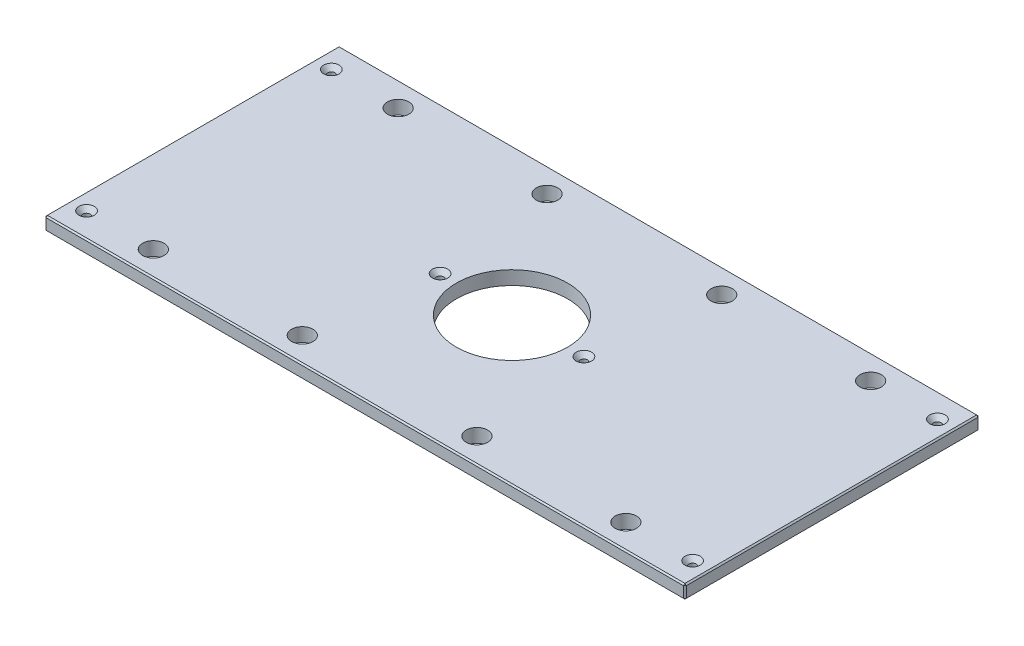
from build123d import *

# Parameters (mm, degrees)
SKETCH1_W                                        = 593.725
SKETCH1_H                                        = 273.05
BOSS_EXTRUDE1_DEPTH                              = 12.7
SKETCH13_R                                       = 51.562
CUT_EXTRUDE6_DEPTH                               = 327.9980268
F_25_32_0_78125_DIAMETER_HOLE1_D                 = 19.84375
CHAMFER2_SIZE                                    = 1.27
CSK_FOR_1_4_FLAT_HEAD_MACHINE_SCREW1_D           = 6.7564
CSK_FOR_1_4_FLAT_HEAD_MACHINE_SCREW1_CSINK_D     = 14.2748
CSK_FOR_1_4_FLAT_HEAD_MACHINE_SCREW1_CSINK_ANGLE = 82


with BuildPart() as part:
    # Sketch1 → Boss-Extrude1 (new body)
    with BuildSketch(Plane(origin=(0, 0, 0), x_dir=(1, 0, 0), z_dir=(0, 1, 0))):
        Rectangle(SKETCH1_W, SKETCH1_H)
    extrude(amount=BOSS_EXTRUDE1_DEPTH)

    # Sketch13 → Cut-Extrude6 (cut, through all)
    with BuildSketch(Plane(origin=(0, 12.7, 0), x_dir=(1, 0, 0), z_dir=(0, 1, 0))):
        with Locations(Location((0, 0, 0), (0, 0, 270))):
            Circle(SKETCH13_R)
    extrude(amount=-CUT_EXTRUDE6_DEPTH, mode=Mode.SUBTRACT)

    # 25_32 _0.78125_ Diameter Hole1 (through all)
    with Locations(Plane(origin=(0, 12.7, 0), x_dir=(1, 0, 0), z_dir=(0, 1, 0))):
        with Locations((219.075, 113.50498), (-219.075, 113.50498), (219.075, -113.50498), (-219.075, -113.50498), (-80.9625, 113.50498), (80.9625, 113.50498), (80.9625, -113.50498), (-80.9625, -113.50498)):
            Hole(F_25_32_0_78125_DIAMETER_HOLE1_D / 2)

    # Chamfer2
    chamfer2_edges = [part.edges().sort_by_distance(p)[0] for p in [
        (296.8625, 12.7, 0),
        (0, 12.7, -136.525),
        (-296.8625, 12.7, 0),
        (0, 0, -136.525),
        (296.8625, 0, 0),
        (0, 0, 136.525),
        (-296.8625, 0, 0),
        (0, 12.7, 136.525),
        (-296.8625, 6.35, -136.525),
        (296.8625, 6.35, -136.525),
        (296.8625, 6.35, 136.525),
        (-296.8625, 6.35, 136.525),
    ]]
    chamfer(chamfer2_edges, length=CHAMFER2_SIZE)

    # CSK for 1_4 Flat Head Machine Screw1 (through all)
    with Locations(Plane(origin=(0, 12.7, 0), x_dir=(1, 0, 0), z_dir=(0, 1, 0))):
        with Locations((280.9875, 113.50498), (280.9875, -113.50498), (-280.9875, -113.50498), (-66.675, 0), (66.675, 0), (-280.9875, 113.50498), (-219.075, 113.50498), (-219.075, -113.50498)):
            CounterSinkHole(CSK_FOR_1_4_FLAT_HEAD_MACHINE_SCREW1_D / 2, CSK_FOR_1_4_FLAT_HEAD_MACHINE_SCREW1_CSINK_D / 2, counter_sink_angle=CSK_FOR_1_4_FLAT_HEAD_MACHINE_SCREW1_CSINK_ANGLE)


solid = part.part
